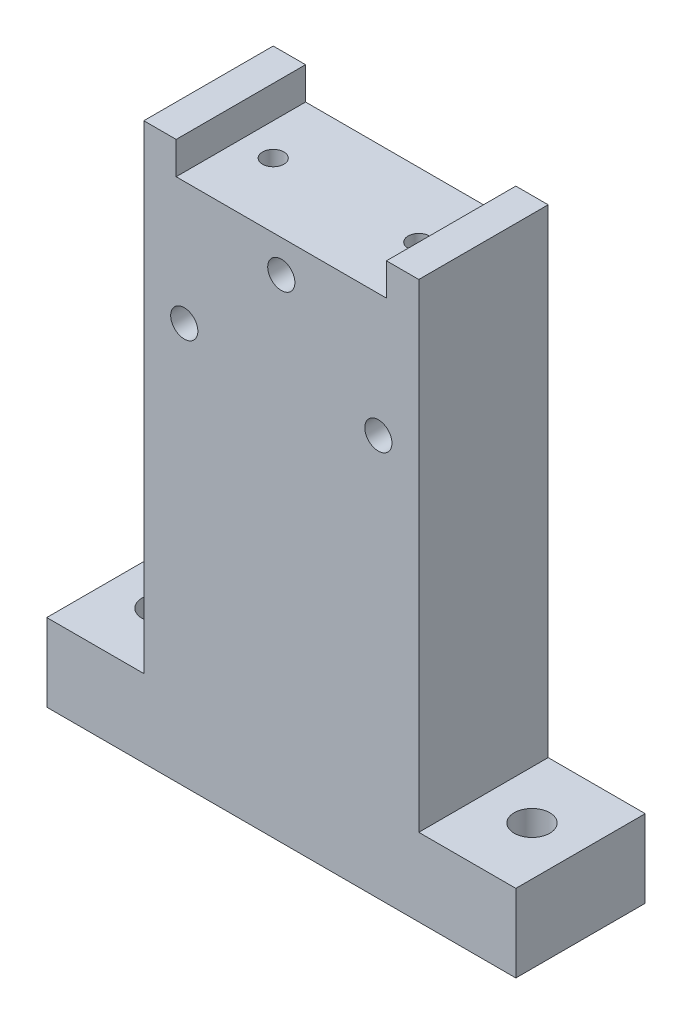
from build123d import *

# Parameters (mm, degrees)
EXTRUDE_1_DEPTH     = 20
SKETCH_2_R          = 2.1
CUT_EXTRUDE_1_DEPTH = 20
SKETCH_3_R          = 2.75
CUT_EXTRUDE_2_DEPTH = 20
SKETCH_4_R          = 1.65
CUT_EXTRUDE_3_DEPTH = 12


with BuildPart() as part:
    # Sketch 1 → Extrude 1 (new body)
    with BuildSketch(Plane.XY):
        Polygon((20, 81), (20, 86), (15, 86), (15, 12), (0, 12), (0, 0), (72.5, 0), (72.5, 12), (57.5, 12), (57.5, 86), (52.5, 86), (52.5, 81), align=None)
    extrude(amount=EXTRUDE_1_DEPTH)

    # Sketch 2 → Cut-Extrude 1 (cut)
    with BuildSketch(Plane.XY.offset(20)):
        with Locations((21.25, 62)):
            Circle(SKETCH_2_R)
        with Locations((51.25, 62)):
            Circle(SKETCH_2_R)
        with Locations((36.25, 76)):
            Circle(SKETCH_2_R)
    extrude(amount=-CUT_EXTRUDE_1_DEPTH, mode=Mode.SUBTRACT)

    # Sketch 3 → Cut-Extrude 2 (cut)
    with BuildSketch(Plane(origin=(0, 12, 0), x_dir=(1, 0, 0), z_dir=(0, 1, 0))):
        with Locations(Location((7.5, -10, 0), (0, 0, 270))):
            Circle(SKETCH_3_R)
        with Locations(Location((65, -10, 0), (0, 0, 270))):
            Circle(SKETCH_3_R)
    extrude(amount=-CUT_EXTRUDE_2_DEPTH, mode=Mode.SUBTRACT)

    # Sketch 4 → Cut-Extrude 3 (cut)
    with BuildSketch(Plane(origin=(0, 81, 0), x_dir=(1, 0, 0), z_dir=(0, 1, 0))):
        with Locations(Location((25, -10, 0), (0, 0, 270))):
            Circle(SKETCH_4_R)
        with Locations(Location((47.5, -10, 0), (0, 0, 270))):
            Circle(SKETCH_4_R)
    extrude(amount=-CUT_EXTRUDE_3_DEPTH, mode=Mode.SUBTRACT)


solid = part.part
